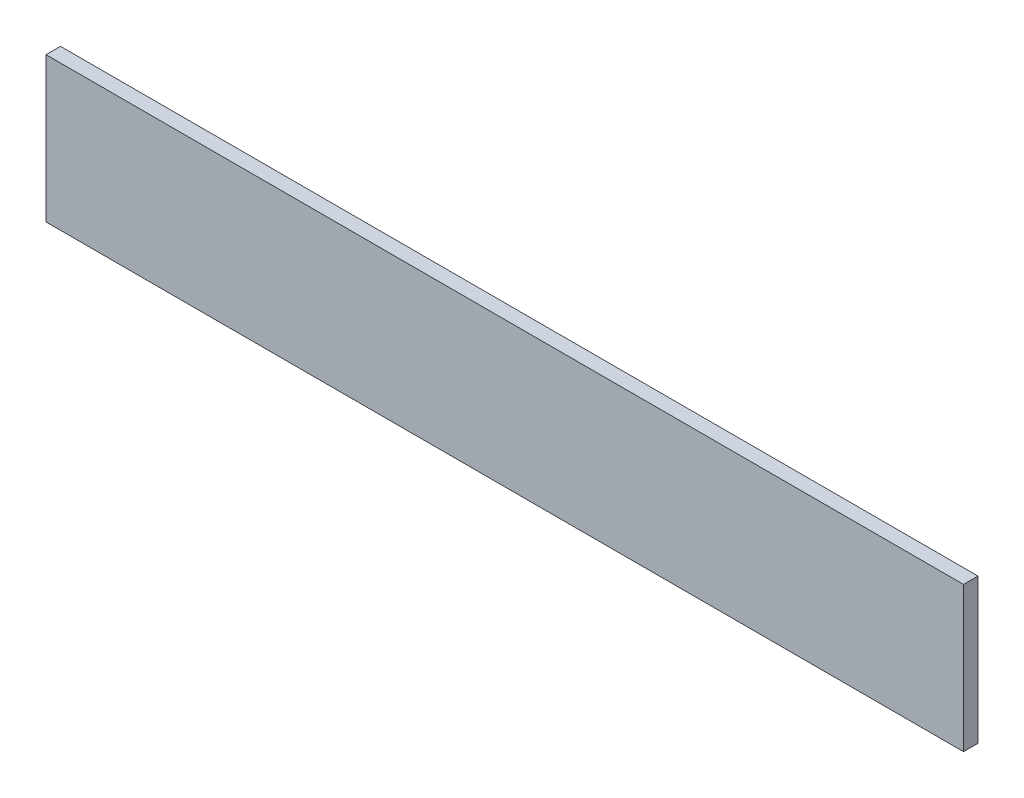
from build123d import *

# Parameters (mm, degrees)
SKETCH_1_W      = 380
SKETCH_1_H      = 60
EXTRUDE_1_DEPTH = 6


with BuildPart() as part:
    # Sketch 1 → Extrude 1 (new body)
    with BuildSketch(Plane.XY):
        with Locations((190, 30)):
            Rectangle(SKETCH_1_W, SKETCH_1_H)
    extrude(amount=EXTRUDE_1_DEPTH)


solid = part.part
